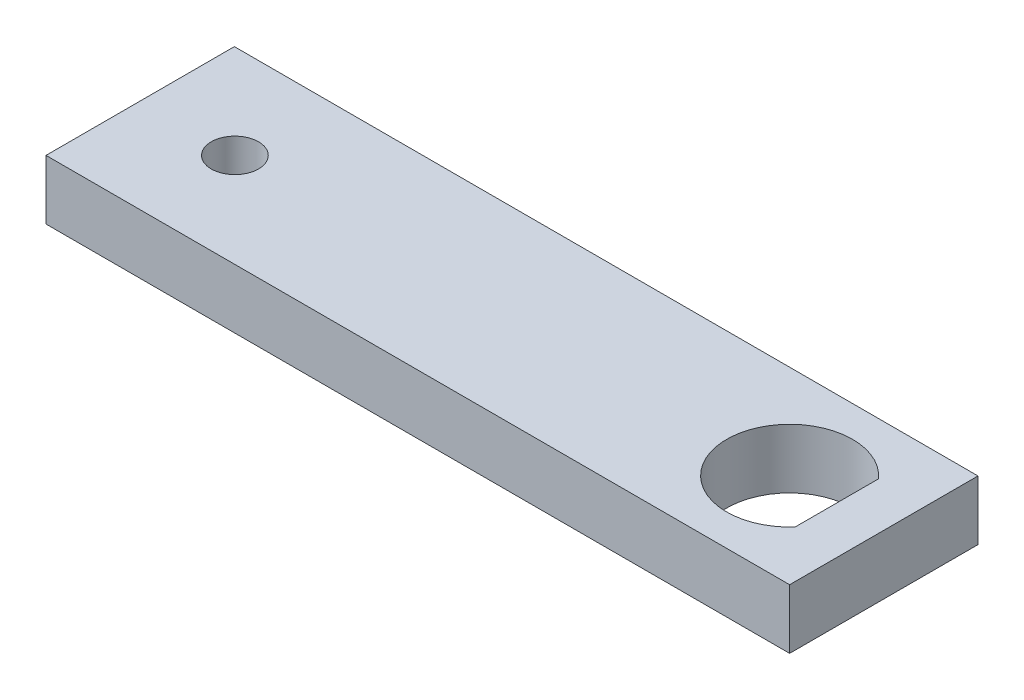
ISO-10303-21;
HEADER;
FILE_DESCRIPTION(('STEP AP214'),'2;1');
FILE_NAME('part.step','',(''),(''),'','','');
FILE_SCHEMA(('AUTOMOTIVE_DESIGN { 1 0 10303 214 1 1 1 1 }'));
ENDSEC;
DATA;
#1=APPLICATION_CONTEXT('core data for automotive mechanical design processes');
#2=APPLICATION_PROTOCOL_DEFINITION('international standard','automotive_design',2000,#1);
#3=PRODUCT_CONTEXT('',#1,'mechanical');
#4=PRODUCT('Part','Part','',(#3));
#5=PRODUCT_RELATED_PRODUCT_CATEGORY('part','',(#4));
#6=PRODUCT_DEFINITION_FORMATION('','',#4);
#7=PRODUCT_DEFINITION_CONTEXT('part definition',#1,'design');
#8=PRODUCT_DEFINITION('design','',#6,#7);
#9=PRODUCT_DEFINITION_SHAPE('','',#8);
#10=(LENGTH_UNIT() NAMED_UNIT(*) SI_UNIT(.MILLI.,.METRE.));
#11=(NAMED_UNIT(*) PLANE_ANGLE_UNIT() SI_UNIT($,.RADIAN.));
#12=(NAMED_UNIT(*) SI_UNIT($,.STERADIAN.) SOLID_ANGLE_UNIT());
#13=UNCERTAINTY_MEASURE_WITH_UNIT(LENGTH_MEASURE(1.E-05),#10,'distance_accuracy_value','');
#14=(GEOMETRIC_REPRESENTATION_CONTEXT(3) GLOBAL_UNCERTAINTY_ASSIGNED_CONTEXT((#13)) GLOBAL_UNIT_ASSIGNED_CONTEXT((#10,
#11,#12)) REPRESENTATION_CONTEXT('',''));
#15=CARTESIAN_POINT('',(0.,0.,0.));
#16=DIRECTION('',(0.,0.,1.));
#17=DIRECTION('',(1.,0.,0.));
#18=AXIS2_PLACEMENT_3D('',#15,#16,#17);
#19=CARTESIAN_POINT('',(0.,0.,19.));
#20=DIRECTION('',(-1.,0.,0.));
#21=DIRECTION('',(0.,-1.,0.));
#22=AXIS2_PLACEMENT_3D('',#19,#20,#21);
#23=PLANE('',#22);
#24=DIRECTION('',(0.,1.,0.));
#25=VECTOR('',#24,1.);
#26=CARTESIAN_POINT('',(0.,0.,0.));
#27=LINE('',#26,#25);
#28=CARTESIAN_POINT('',(0.,0.,0.));
#29=VERTEX_POINT('',#28);
#30=CARTESIAN_POINT('',(0.,6.00000000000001,0.));
#31=VERTEX_POINT('',#30);
#32=EDGE_CURVE('E112',#29,#31,#27,.T.);
#33=ORIENTED_EDGE('',*,*,#32,.F.);
#34=DIRECTION('',(0.,0.,-1.));
#35=VECTOR('',#34,1.);
#36=CARTESIAN_POINT('',(0.,0.,19.));
#37=LINE('',#36,#35);
#38=CARTESIAN_POINT('',(0.,0.,19.));
#39=VERTEX_POINT('',#38);
#40=EDGE_CURVE('E11',#39,#29,#37,.T.);
#41=ORIENTED_EDGE('',*,*,#40,.F.);
#42=DIRECTION('',(0.,1.,0.));
#43=VECTOR('',#42,1.);
#44=CARTESIAN_POINT('',(0.,0.,19.));
#45=LINE('',#44,#43);
#46=CARTESIAN_POINT('',(0.,6.00000000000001,19.));
#47=VERTEX_POINT('',#46);
#48=EDGE_CURVE('E114',#39,#47,#45,.T.);
#49=ORIENTED_EDGE('',*,*,#48,.T.);
#50=DIRECTION('',(0.,0.,-1.));
#51=VECTOR('',#50,1.);
#52=CARTESIAN_POINT('',(0.,6.00000000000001,19.));
#53=LINE('',#52,#51);
#54=EDGE_CURVE('E42',#47,#31,#53,.T.);
#55=ORIENTED_EDGE('',*,*,#54,.T.);
#56=EDGE_LOOP('',(#33,#41,#49,#55));
#57=FACE_BOUND('',#56,.T.);
#58=ADVANCED_FACE('F39',(#57),#23,.T.);
#59=CARTESIAN_POINT('',(0.,0.,19.));
#60=DIRECTION('',(0.,1.,0.));
#61=DIRECTION('',(0.,0.,1.));
#62=AXIS2_PLACEMENT_3D('',#59,#60,#61);
#63=PLANE('',#62);
#64=CARTESIAN_POINT('',(9.525,0.,9.475));
#65=DIRECTION('',(0.,1.,0.));
#66=DIRECTION('',(-1.,0.,0.));
#67=AXIS2_PLACEMENT_3D('',#64,#65,#66);
#68=CIRCLE('',#67,2.38125);
#69=CARTESIAN_POINT('',(7.14375,0.,9.475));
#70=VERTEX_POINT('',#69);
#71=EDGE_CURVE('E110',#70,#70,#68,.T.);
#72=ORIENTED_EDGE('',*,*,#71,.T.);
#73=EDGE_LOOP('',(#72));
#74=FACE_BOUND('',#73,.T.);
#75=DIRECTION('',(0.,0.,1.));
#76=VECTOR('',#75,1.);
#77=CARTESIAN_POINT('',(70.2375,0.,5.27486979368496));
#78=LINE('',#77,#76);
#79=CARTESIAN_POINT('',(70.2375,0.,5.27486979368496));
#80=VERTEX_POINT('',#79);
#81=CARTESIAN_POINT('',(70.2375,0.,13.675130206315));
#82=VERTEX_POINT('',#81);
#83=EDGE_CURVE('E91',#80,#82,#78,.T.);
#84=ORIENTED_EDGE('',*,*,#83,.F.);
#85=CARTESIAN_POINT('',(65.475,0.,9.47499999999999));
#86=DIRECTION('',(0.,1.,0.));
#87=DIRECTION('',(-1.,0.,0.));
#88=AXIS2_PLACEMENT_3D('',#85,#86,#87);
#89=CIRCLE('',#88,6.35);
#90=EDGE_CURVE('E55',#80,#82,#89,.T.);
#91=ORIENTED_EDGE('',*,*,#90,.T.);
#92=EDGE_LOOP('',(#84,#91));
#93=FACE_BOUND('',#92,.T.);
#94=DIRECTION('',(1.,0.,0.));
#95=VECTOR('',#94,1.);
#96=CARTESIAN_POINT('',(0.,0.,0.));
#97=LINE('',#96,#95);
#98=CARTESIAN_POINT('',(75.,0.,0.));
#99=VERTEX_POINT('',#98);
#100=EDGE_CURVE('E118',#29,#99,#97,.T.);
#101=ORIENTED_EDGE('',*,*,#100,.T.);
#102=DIRECTION('',(0.,0.,-1.));
#103=VECTOR('',#102,1.);
#104=CARTESIAN_POINT('',(75.,0.,19.));
#105=LINE('',#104,#103);
#106=CARTESIAN_POINT('',(75.,0.,19.));
#107=VERTEX_POINT('',#106);
#108=EDGE_CURVE('E47',#107,#99,#105,.T.);
#109=ORIENTED_EDGE('',*,*,#108,.F.);
#110=DIRECTION('',(1.,0.,0.));
#111=VECTOR('',#110,1.);
#112=CARTESIAN_POINT('',(0.,0.,19.));
#113=LINE('',#112,#111);
#114=EDGE_CURVE('E123',#39,#107,#113,.T.);
#115=ORIENTED_EDGE('',*,*,#114,.F.);
#116=ORIENTED_EDGE('',*,*,#40,.T.);
#117=EDGE_LOOP('',(#101,#109,#115,#116));
#118=FACE_BOUND('',#117,.T.);
#119=ADVANCED_FACE('F101',(#74,#93,#118),#63,.F.);
#120=CARTESIAN_POINT('',(75.,6.00000000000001,19.));
#121=DIRECTION('',(1.,0.,0.));
#122=DIRECTION('',(0.,0.,-1.));
#123=AXIS2_PLACEMENT_3D('',#120,#121,#122);
#124=PLANE('',#123);
#125=DIRECTION('',(0.,-1.,0.));
#126=VECTOR('',#125,1.);
#127=CARTESIAN_POINT('',(75.,5.99999999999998,0.));
#128=LINE('',#127,#126);
#129=CARTESIAN_POINT('',(75.,5.99999999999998,0.));
#130=VERTEX_POINT('',#129);
#131=EDGE_CURVE('E130',#130,#99,#128,.T.);
#132=ORIENTED_EDGE('',*,*,#131,.F.);
#133=DIRECTION('',(0.,0.,-1.));
#134=VECTOR('',#133,1.);
#135=CARTESIAN_POINT('',(75.,6.00000000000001,19.));
#136=LINE('',#135,#134);
#137=CARTESIAN_POINT('',(75.,6.00000000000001,19.));
#138=VERTEX_POINT('',#137);
#139=EDGE_CURVE('E136',#138,#130,#136,.T.);
#140=ORIENTED_EDGE('',*,*,#139,.F.);
#141=DIRECTION('',(0.,-1.,0.));
#142=VECTOR('',#141,1.);
#143=CARTESIAN_POINT('',(75.,6.00000000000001,19.));
#144=LINE('',#143,#142);
#145=EDGE_CURVE('E120',#138,#107,#144,.T.);
#146=ORIENTED_EDGE('',*,*,#145,.T.);
#147=ORIENTED_EDGE('',*,*,#108,.T.);
#148=EDGE_LOOP('',(#132,#140,#146,#147));
#149=FACE_BOUND('',#148,.T.);
#150=ADVANCED_FACE('F155',(#149),#124,.T.);
#151=CARTESIAN_POINT('',(75.,6.00000000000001,19.));
#152=DIRECTION('',(0.,-1.,0.));
#153=DIRECTION('',(1.,0.,0.));
#154=AXIS2_PLACEMENT_3D('',#151,#152,#153);
#155=PLANE('',#154);
#156=CARTESIAN_POINT('',(9.525,6.00000000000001,9.47499999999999));
#157=DIRECTION('',(0.,1.,0.));
#158=DIRECTION('',(-1.,0.,0.));
#159=AXIS2_PLACEMENT_3D('',#156,#157,#158);
#160=CIRCLE('',#159,2.38125);
#161=CARTESIAN_POINT('',(7.14375,6.00000000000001,9.47499999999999));
#162=VERTEX_POINT('',#161);
#163=EDGE_CURVE('E107',#162,#162,#160,.T.);
#164=ORIENTED_EDGE('',*,*,#163,.F.);
#165=EDGE_LOOP('',(#164));
#166=FACE_BOUND('',#165,.T.);
#167=DIRECTION('',(0.,0.,1.));
#168=VECTOR('',#167,1.);
#169=CARTESIAN_POINT('',(70.2375,6.00000000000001,5.27486979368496));
#170=LINE('',#169,#168);
#171=CARTESIAN_POINT('',(70.2375,6.00000000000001,5.27486979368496));
#172=VERTEX_POINT('',#171);
#173=CARTESIAN_POINT('',(70.2375,6.00000000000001,13.675130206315));
#174=VERTEX_POINT('',#173);
#175=EDGE_CURVE('E103',#172,#174,#170,.T.);
#176=ORIENTED_EDGE('',*,*,#175,.T.);
#177=CARTESIAN_POINT('',(65.475,6.00000000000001,9.475));
#178=DIRECTION('',(0.,1.,0.));
#179=DIRECTION('',(-1.,0.,0.));
#180=AXIS2_PLACEMENT_3D('',#177,#178,#179);
#181=CIRCLE('',#180,6.35);
#182=EDGE_CURVE('E60',#172,#174,#181,.T.);
#183=ORIENTED_EDGE('',*,*,#182,.F.);
#184=EDGE_LOOP('',(#176,#183));
#185=FACE_BOUND('',#184,.T.);
#186=DIRECTION('',(-1.,0.,0.));
#187=VECTOR('',#186,1.);
#188=CARTESIAN_POINT('',(75.,5.99999999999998,0.));
#189=LINE('',#188,#187);
#190=EDGE_CURVE('E127',#130,#31,#189,.T.);
#191=ORIENTED_EDGE('',*,*,#190,.T.);
#192=ORIENTED_EDGE('',*,*,#54,.F.);
#193=DIRECTION('',(-1.,0.,0.));
#194=VECTOR('',#193,1.);
#195=CARTESIAN_POINT('',(75.,6.00000000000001,19.));
#196=LINE('',#195,#194);
#197=EDGE_CURVE('E117',#138,#47,#196,.T.);
#198=ORIENTED_EDGE('',*,*,#197,.F.);
#199=ORIENTED_EDGE('',*,*,#139,.T.);
#200=EDGE_LOOP('',(#191,#192,#198,#199));
#201=FACE_BOUND('',#200,.T.);
#202=ADVANCED_FACE('F144',(#166,#185,#201),#155,.F.);
#203=CARTESIAN_POINT('',(0.,0.,19.));
#204=DIRECTION('',(0.,0.,-1.));
#205=DIRECTION('',(-1.,0.,0.));
#206=AXIS2_PLACEMENT_3D('',#203,#204,#205);
#207=PLANE('',#206);
#208=ORIENTED_EDGE('',*,*,#48,.F.);
#209=ORIENTED_EDGE('',*,*,#114,.T.);
#210=ORIENTED_EDGE('',*,*,#145,.F.);
#211=ORIENTED_EDGE('',*,*,#197,.T.);
#212=EDGE_LOOP('',(#208,#209,#210,#211));
#213=FACE_BOUND('',#212,.T.);
#214=ADVANCED_FACE('F153',(#213),#207,.F.);
#215=CARTESIAN_POINT('',(0.,0.,0.));
#216=DIRECTION('',(0.,0.,-1.));
#217=DIRECTION('',(-1.,0.,0.));
#218=AXIS2_PLACEMENT_3D('',#215,#216,#217);
#219=PLANE('',#218);
#220=ORIENTED_EDGE('',*,*,#32,.T.);
#221=ORIENTED_EDGE('',*,*,#190,.F.);
#222=ORIENTED_EDGE('',*,*,#131,.T.);
#223=ORIENTED_EDGE('',*,*,#100,.F.);
#224=EDGE_LOOP('',(#220,#221,#222,#223));
#225=FACE_BOUND('',#224,.T.);
#226=ADVANCED_FACE('F148',(#225),#219,.T.);
#227=CARTESIAN_POINT('',(65.475,0.,9.47499999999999));
#228=DIRECTION('',(0.,1.,0.));
#229=DIRECTION('',(-1.,0.,0.));
#230=AXIS2_PLACEMENT_3D('',#227,#228,#229);
#231=CYLINDRICAL_SURFACE('',#230,6.35);
#232=ORIENTED_EDGE('',*,*,#182,.T.);
#233=DIRECTION('',(0.,1.,0.));
#234=VECTOR('',#233,1.);
#235=CARTESIAN_POINT('',(70.2375,0.,13.675130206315));
#236=LINE('',#235,#234);
#237=EDGE_CURVE('E94',#82,#174,#236,.T.);
#238=ORIENTED_EDGE('',*,*,#237,.F.);
#239=ORIENTED_EDGE('',*,*,#90,.F.);
#240=DIRECTION('',(0.,1.,0.));
#241=VECTOR('',#240,1.);
#242=CARTESIAN_POINT('',(70.2375,0.,5.27486979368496));
#243=LINE('',#242,#241);
#244=EDGE_CURVE('E96',#80,#172,#243,.T.);
#245=ORIENTED_EDGE('',*,*,#244,.T.);
#246=EDGE_LOOP('',(#232,#238,#239,#245));
#247=FACE_BOUND('',#246,.T.);
#248=ADVANCED_FACE('F99',(#247),#231,.F.);
#249=CARTESIAN_POINT('',(70.2375,0.,5.27486979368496));
#250=DIRECTION('',(-1.,0.,0.));
#251=DIRECTION('',(0.,-1.,0.));
#252=AXIS2_PLACEMENT_3D('',#249,#250,#251);
#253=PLANE('',#252);
#254=ORIENTED_EDGE('',*,*,#175,.F.);
#255=ORIENTED_EDGE('',*,*,#244,.F.);
#256=ORIENTED_EDGE('',*,*,#83,.T.);
#257=ORIENTED_EDGE('',*,*,#237,.T.);
#258=EDGE_LOOP('',(#254,#255,#256,#257));
#259=FACE_BOUND('',#258,.T.);
#260=ADVANCED_FACE('F93',(#259),#253,.T.);
#261=CARTESIAN_POINT('',(9.525,0.,9.475));
#262=DIRECTION('',(0.,1.,0.));
#263=DIRECTION('',(-1.,0.,0.));
#264=AXIS2_PLACEMENT_3D('',#261,#262,#263);
#265=CYLINDRICAL_SURFACE('',#264,2.38125);
#266=ORIENTED_EDGE('',*,*,#71,.F.);
#267=EDGE_LOOP('',(#266));
#268=FACE_BOUND('',#267,.T.);
#269=ORIENTED_EDGE('',*,*,#163,.T.);
#270=EDGE_LOOP('',(#269));
#271=FACE_BOUND('',#270,.T.);
#272=ADVANCED_FACE('F209',(#268,#271),#265,.F.);
#273=CLOSED_SHELL('',(#58,#119,#150,#202,#214,#226,#248,#260,#272));
#274=MANIFOLD_SOLID_BREP('B2',#273);
#275=ADVANCED_BREP_SHAPE_REPRESENTATION('',(#18,#274),#14);
#276=SHAPE_DEFINITION_REPRESENTATION(#9,#275);
ENDSEC;
END-ISO-10303-21;
